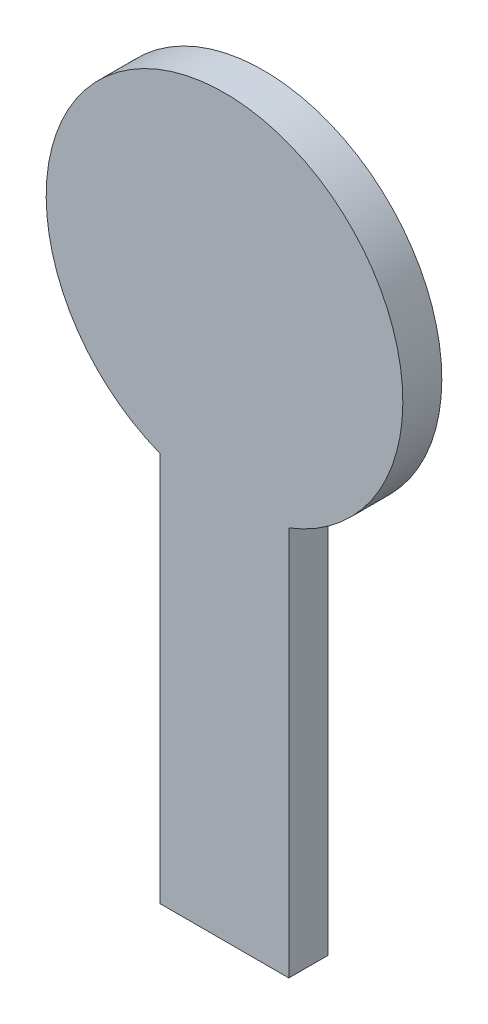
ISO-10303-21;
HEADER;
FILE_DESCRIPTION(('STEP AP214'),'2;1');
FILE_NAME('part.step','',(''),(''),'','','');
FILE_SCHEMA(('AUTOMOTIVE_DESIGN { 1 0 10303 214 1 1 1 1 }'));
ENDSEC;
DATA;
#1=APPLICATION_CONTEXT('core data for automotive mechanical design processes');
#2=APPLICATION_PROTOCOL_DEFINITION('international standard','automotive_design',2000,#1);
#3=PRODUCT_CONTEXT('',#1,'mechanical');
#4=PRODUCT('Part','Part','',(#3));
#5=PRODUCT_RELATED_PRODUCT_CATEGORY('part','',(#4));
#6=PRODUCT_DEFINITION_FORMATION('','',#4);
#7=PRODUCT_DEFINITION_CONTEXT('part definition',#1,'design');
#8=PRODUCT_DEFINITION('design','',#6,#7);
#9=PRODUCT_DEFINITION_SHAPE('','',#8);
#10=(LENGTH_UNIT() NAMED_UNIT(*) SI_UNIT(.MILLI.,.METRE.));
#11=(NAMED_UNIT(*) PLANE_ANGLE_UNIT() SI_UNIT($,.RADIAN.));
#12=(NAMED_UNIT(*) SI_UNIT($,.STERADIAN.) SOLID_ANGLE_UNIT());
#13=UNCERTAINTY_MEASURE_WITH_UNIT(LENGTH_MEASURE(1.E-05),#10,'distance_accuracy_value','');
#14=(GEOMETRIC_REPRESENTATION_CONTEXT(3) GLOBAL_UNCERTAINTY_ASSIGNED_CONTEXT((#13)) GLOBAL_UNIT_ASSIGNED_CONTEXT((#10,
#11,#12)) REPRESENTATION_CONTEXT('',''));
#15=CARTESIAN_POINT('',(0.,0.,0.));
#16=DIRECTION('',(0.,0.,1.));
#17=DIRECTION('',(1.,0.,0.));
#18=AXIS2_PLACEMENT_3D('',#15,#16,#17);
#19=CARTESIAN_POINT('',(-3.3,-28.5341959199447,2.));
#20=DIRECTION('',(1.,0.,0.));
#21=DIRECTION('',(0.,0.,-1.));
#22=AXIS2_PLACEMENT_3D('',#19,#20,#21);
#23=PLANE('',#22);
#24=DIRECTION('',(0.,-1.,0.));
#25=VECTOR('',#24,1.);
#26=CARTESIAN_POINT('',(-3.3,-28.5341959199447,0.));
#27=LINE('',#26,#25);
#28=CARTESIAN_POINT('',(-3.30000000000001,-8.53419591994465,0.));
#29=VERTEX_POINT('',#28);
#30=CARTESIAN_POINT('',(-3.3,-28.5341959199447,0.));
#31=VERTEX_POINT('',#30);
#32=EDGE_CURVE('E101',#29,#31,#27,.T.);
#33=ORIENTED_EDGE('',*,*,#32,.T.);
#34=DIRECTION('',(0.,0.,-1.));
#35=VECTOR('',#34,1.);
#36=CARTESIAN_POINT('',(-3.3,-28.5341959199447,2.));
#37=LINE('',#36,#35);
#38=CARTESIAN_POINT('',(-3.3,-28.5341959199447,2.));
#39=VERTEX_POINT('',#38);
#40=EDGE_CURVE('E11',#39,#31,#37,.T.);
#41=ORIENTED_EDGE('',*,*,#40,.F.);
#42=DIRECTION('',(0.,-1.,0.));
#43=VECTOR('',#42,1.);
#44=CARTESIAN_POINT('',(-3.3,-28.5341959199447,2.));
#45=LINE('',#44,#43);
#46=CARTESIAN_POINT('',(-3.30000000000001,-8.53419591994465,2.));
#47=VERTEX_POINT('',#46);
#48=EDGE_CURVE('E89',#47,#39,#45,.T.);
#49=ORIENTED_EDGE('',*,*,#48,.F.);
#50=DIRECTION('',(0.,0.,-1.));
#51=VECTOR('',#50,1.);
#52=CARTESIAN_POINT('',(-3.30000000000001,-8.53419591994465,2.));
#53=LINE('',#52,#51);
#54=EDGE_CURVE('E97',#47,#29,#53,.T.);
#55=ORIENTED_EDGE('',*,*,#54,.T.);
#56=EDGE_LOOP('',(#33,#41,#49,#55));
#57=FACE_BOUND('',#56,.T.);
#58=ADVANCED_FACE('F38',(#57),#23,.F.);
#59=CARTESIAN_POINT('',(-3.3,-28.5341959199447,2.));
#60=DIRECTION('',(0.,1.,0.));
#61=DIRECTION('',(0.,0.,1.));
#62=AXIS2_PLACEMENT_3D('',#59,#60,#61);
#63=PLANE('',#62);
#64=DIRECTION('',(1.,0.,0.));
#65=VECTOR('',#64,1.);
#66=CARTESIAN_POINT('',(-3.3,-28.5341959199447,0.));
#67=LINE('',#66,#65);
#68=CARTESIAN_POINT('',(3.3,-28.5341959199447,0.));
#69=VERTEX_POINT('',#68);
#70=EDGE_CURVE('E93',#31,#69,#67,.T.);
#71=ORIENTED_EDGE('',*,*,#70,.T.);
#72=DIRECTION('',(0.,0.,-1.));
#73=VECTOR('',#72,1.);
#74=CARTESIAN_POINT('',(3.3,-28.5341959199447,2.));
#75=LINE('',#74,#73);
#76=CARTESIAN_POINT('',(3.3,-28.5341959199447,2.));
#77=VERTEX_POINT('',#76);
#78=EDGE_CURVE('E46',#77,#69,#75,.T.);
#79=ORIENTED_EDGE('',*,*,#78,.F.);
#80=DIRECTION('',(1.,0.,0.));
#81=VECTOR('',#80,1.);
#82=CARTESIAN_POINT('',(-3.3,-28.5341959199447,2.));
#83=LINE('',#82,#81);
#84=EDGE_CURVE('E84',#39,#77,#83,.T.);
#85=ORIENTED_EDGE('',*,*,#84,.F.);
#86=ORIENTED_EDGE('',*,*,#40,.T.);
#87=EDGE_LOOP('',(#71,#79,#85,#86));
#88=FACE_BOUND('',#87,.T.);
#89=ADVANCED_FACE('F92',(#88),#63,.F.);
#90=CARTESIAN_POINT('',(3.3,-28.5341959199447,2.));
#91=DIRECTION('',(-1.,0.,0.));
#92=DIRECTION('',(0.,0.,1.));
#93=AXIS2_PLACEMENT_3D('',#90,#91,#92);
#94=PLANE('',#93);
#95=DIRECTION('',(0.,1.,0.));
#96=VECTOR('',#95,1.);
#97=CARTESIAN_POINT('',(3.3,-28.5341959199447,0.));
#98=LINE('',#97,#96);
#99=CARTESIAN_POINT('',(3.3,-8.53419591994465,0.));
#100=VERTEX_POINT('',#99);
#101=EDGE_CURVE('E71',#69,#100,#98,.T.);
#102=ORIENTED_EDGE('',*,*,#101,.T.);
#103=DIRECTION('',(0.,0.,-1.));
#104=VECTOR('',#103,1.);
#105=CARTESIAN_POINT('',(3.3,-8.53419591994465,2.));
#106=LINE('',#105,#104);
#107=CARTESIAN_POINT('',(3.3,-8.53419591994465,2.));
#108=VERTEX_POINT('',#107);
#109=EDGE_CURVE('E94',#108,#100,#106,.T.);
#110=ORIENTED_EDGE('',*,*,#109,.F.);
#111=DIRECTION('',(0.,1.,0.));
#112=VECTOR('',#111,1.);
#113=CARTESIAN_POINT('',(3.3,-28.5341959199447,2.));
#114=LINE('',#113,#112);
#115=EDGE_CURVE('E87',#77,#108,#114,.T.);
#116=ORIENTED_EDGE('',*,*,#115,.F.);
#117=ORIENTED_EDGE('',*,*,#78,.T.);
#118=EDGE_LOOP('',(#102,#110,#116,#117));
#119=FACE_BOUND('',#118,.T.);
#120=ADVANCED_FACE('F95',(#119),#94,.F.);
#121=CARTESIAN_POINT('',(0.,0.,2.));
#122=DIRECTION('',(0.,0.,-1.));
#123=DIRECTION('',(-1.,0.,0.));
#124=AXIS2_PLACEMENT_3D('',#121,#122,#123);
#125=CYLINDRICAL_SURFACE('',#124,9.15);
#126=CARTESIAN_POINT('',(0.,0.,0.));
#127=DIRECTION('',(0.,0.,1.));
#128=DIRECTION('',(1.,0.,0.));
#129=AXIS2_PLACEMENT_3D('',#126,#127,#128);
#130=CIRCLE('',#129,9.15);
#131=EDGE_CURVE('E77',#100,#29,#130,.T.);
#132=ORIENTED_EDGE('',*,*,#131,.T.);
#133=ORIENTED_EDGE('',*,*,#54,.F.);
#134=CARTESIAN_POINT('',(0.,0.,2.));
#135=DIRECTION('',(0.,0.,1.));
#136=DIRECTION('',(1.,0.,0.));
#137=AXIS2_PLACEMENT_3D('',#134,#135,#136);
#138=CIRCLE('',#137,9.15);
#139=EDGE_CURVE('E54',#108,#47,#138,.T.);
#140=ORIENTED_EDGE('',*,*,#139,.F.);
#141=ORIENTED_EDGE('',*,*,#109,.T.);
#142=EDGE_LOOP('',(#132,#133,#140,#141));
#143=FACE_BOUND('',#142,.T.);
#144=ADVANCED_FACE('F108',(#143),#125,.T.);
#145=CARTESIAN_POINT('',(0.,0.,2.));
#146=DIRECTION('',(0.,0.,1.));
#147=DIRECTION('',(1.,0.,0.));
#148=AXIS2_PLACEMENT_3D('',#145,#146,#147);
#149=PLANE('',#148);
#150=ORIENTED_EDGE('',*,*,#48,.T.);
#151=ORIENTED_EDGE('',*,*,#84,.T.);
#152=ORIENTED_EDGE('',*,*,#115,.T.);
#153=ORIENTED_EDGE('',*,*,#139,.T.);
#154=EDGE_LOOP('',(#150,#151,#152,#153));
#155=FACE_BOUND('',#154,.T.);
#156=ADVANCED_FACE('F85',(#155),#149,.T.);
#157=CARTESIAN_POINT('',(0.,0.,0.));
#158=DIRECTION('',(0.,0.,1.));
#159=DIRECTION('',(1.,0.,0.));
#160=AXIS2_PLACEMENT_3D('',#157,#158,#159);
#161=PLANE('',#160);
#162=ORIENTED_EDGE('',*,*,#32,.F.);
#163=ORIENTED_EDGE('',*,*,#131,.F.);
#164=ORIENTED_EDGE('',*,*,#101,.F.);
#165=ORIENTED_EDGE('',*,*,#70,.F.);
#166=EDGE_LOOP('',(#162,#163,#164,#165));
#167=FACE_BOUND('',#166,.T.);
#168=ADVANCED_FACE('F111',(#167),#161,.F.);
#169=CLOSED_SHELL('',(#58,#89,#120,#144,#156,#168));
#170=MANIFOLD_SOLID_BREP('B2',#169);
#171=ADVANCED_BREP_SHAPE_REPRESENTATION('',(#18,#170),#14);
#172=SHAPE_DEFINITION_REPRESENTATION(#9,#171);
ENDSEC;
END-ISO-10303-21;
